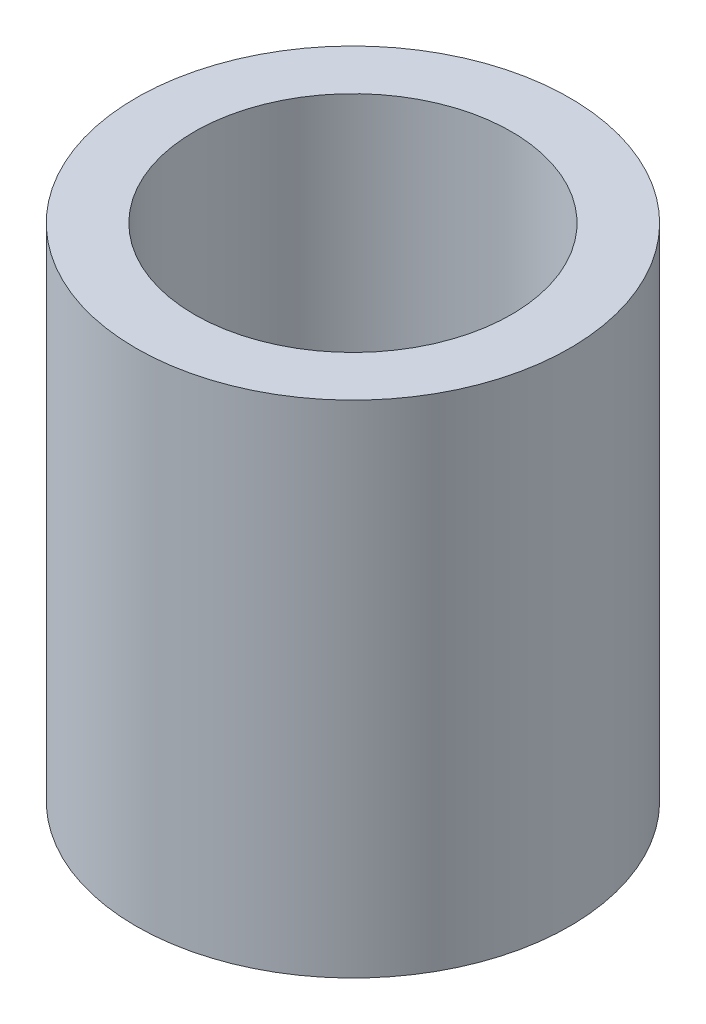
ISO-10303-21;
HEADER;
FILE_DESCRIPTION(('STEP AP214'),'2;1');
FILE_NAME('part.step','',(''),(''),'','','');
FILE_SCHEMA(('AUTOMOTIVE_DESIGN { 1 0 10303 214 1 1 1 1 }'));
ENDSEC;
DATA;
#1=APPLICATION_CONTEXT('core data for automotive mechanical design processes');
#2=APPLICATION_PROTOCOL_DEFINITION('international standard','automotive_design',2000,#1);
#3=PRODUCT_CONTEXT('',#1,'mechanical');
#4=PRODUCT('Part','Part','',(#3));
#5=PRODUCT_RELATED_PRODUCT_CATEGORY('part','',(#4));
#6=PRODUCT_DEFINITION_FORMATION('','',#4);
#7=PRODUCT_DEFINITION_CONTEXT('part definition',#1,'design');
#8=PRODUCT_DEFINITION('design','',#6,#7);
#9=PRODUCT_DEFINITION_SHAPE('','',#8);
#10=(LENGTH_UNIT() NAMED_UNIT(*) SI_UNIT(.MILLI.,.METRE.));
#11=(NAMED_UNIT(*) PLANE_ANGLE_UNIT() SI_UNIT($,.RADIAN.));
#12=(NAMED_UNIT(*) SI_UNIT($,.STERADIAN.) SOLID_ANGLE_UNIT());
#13=UNCERTAINTY_MEASURE_WITH_UNIT(LENGTH_MEASURE(1.E-05),#10,'distance_accuracy_value','');
#14=(GEOMETRIC_REPRESENTATION_CONTEXT(3) GLOBAL_UNCERTAINTY_ASSIGNED_CONTEXT((#13)) GLOBAL_UNIT_ASSIGNED_CONTEXT((#10,
#11,#12)) REPRESENTATION_CONTEXT('',''));
#15=CARTESIAN_POINT('',(0.,0.,0.));
#16=DIRECTION('',(0.,0.,1.));
#17=DIRECTION('',(1.,0.,0.));
#18=AXIS2_PLACEMENT_3D('',#15,#16,#17);
#19=CARTESIAN_POINT('',(0.,30.,0.));
#20=DIRECTION('',(0.,1.,0.));
#21=DIRECTION('',(0.,0.,1.));
#22=AXIS2_PLACEMENT_3D('',#19,#20,#21);
#23=PLANE('',#22);
#24=CARTESIAN_POINT('',(0.,30.,0.));
#25=DIRECTION('',(0.,1.,0.));
#26=DIRECTION('',(0.,0.,1.));
#27=AXIS2_PLACEMENT_3D('',#24,#25,#26);
#28=CIRCLE('',#27,13.);
#29=CARTESIAN_POINT('',(0.,30.,13.));
#30=VERTEX_POINT('',#29);
#31=EDGE_CURVE('E10',#30,#30,#28,.T.);
#32=ORIENTED_EDGE('',*,*,#31,.T.);
#33=EDGE_LOOP('',(#32));
#34=FACE_BOUND('',#33,.T.);
#35=CARTESIAN_POINT('',(0.,30.,0.));
#36=DIRECTION('',(0.,1.,0.));
#37=DIRECTION('',(0.,0.,1.));
#38=AXIS2_PLACEMENT_3D('',#35,#36,#37);
#39=CIRCLE('',#38,9.5);
#40=CARTESIAN_POINT('',(0.,30.,9.5));
#41=VERTEX_POINT('',#40);
#42=EDGE_CURVE('E39',#41,#41,#39,.T.);
#43=ORIENTED_EDGE('',*,*,#42,.F.);
#44=EDGE_LOOP('',(#43));
#45=FACE_BOUND('',#44,.T.);
#46=ADVANCED_FACE('F28',(#34,#45),#23,.T.);
#47=CARTESIAN_POINT('',(0.,0.,0.));
#48=DIRECTION('',(0.,1.,0.));
#49=DIRECTION('',(0.,0.,1.));
#50=AXIS2_PLACEMENT_3D('',#47,#48,#49);
#51=PLANE('',#50);
#52=CARTESIAN_POINT('',(0.,0.,0.));
#53=DIRECTION('',(0.,1.,0.));
#54=DIRECTION('',(0.,0.,1.));
#55=AXIS2_PLACEMENT_3D('',#52,#53,#54);
#56=CIRCLE('',#55,13.);
#57=CARTESIAN_POINT('',(0.,0.,13.));
#58=VERTEX_POINT('',#57);
#59=EDGE_CURVE('E35',#58,#58,#56,.T.);
#60=ORIENTED_EDGE('',*,*,#59,.F.);
#61=EDGE_LOOP('',(#60));
#62=FACE_BOUND('',#61,.T.);
#63=CARTESIAN_POINT('',(0.,0.,0.));
#64=DIRECTION('',(0.,1.,0.));
#65=DIRECTION('',(0.,0.,1.));
#66=AXIS2_PLACEMENT_3D('',#63,#64,#65);
#67=CIRCLE('',#66,9.5);
#68=CARTESIAN_POINT('',(0.,0.,9.5));
#69=VERTEX_POINT('',#68);
#70=EDGE_CURVE('E43',#69,#69,#67,.T.);
#71=ORIENTED_EDGE('',*,*,#70,.T.);
#72=EDGE_LOOP('',(#71));
#73=FACE_BOUND('',#72,.T.);
#74=ADVANCED_FACE('F49',(#62,#73),#51,.F.);
#75=CARTESIAN_POINT('',(0.,30.,0.));
#76=DIRECTION('',(0.,-1.,0.));
#77=DIRECTION('',(0.,0.,-1.));
#78=AXIS2_PLACEMENT_3D('',#75,#76,#77);
#79=CYLINDRICAL_SURFACE('',#78,13.);
#80=ORIENTED_EDGE('',*,*,#31,.F.);
#81=EDGE_LOOP('',(#80));
#82=FACE_BOUND('',#81,.T.);
#83=ORIENTED_EDGE('',*,*,#59,.T.);
#84=EDGE_LOOP('',(#83));
#85=FACE_BOUND('',#84,.T.);
#86=ADVANCED_FACE('F30',(#82,#85),#79,.T.);
#87=CARTESIAN_POINT('',(0.,30.,0.));
#88=DIRECTION('',(0.,-1.,0.));
#89=DIRECTION('',(0.,0.,-1.));
#90=AXIS2_PLACEMENT_3D('',#87,#88,#89);
#91=CYLINDRICAL_SURFACE('',#90,9.5);
#92=ORIENTED_EDGE('',*,*,#42,.T.);
#93=EDGE_LOOP('',(#92));
#94=FACE_BOUND('',#93,.T.);
#95=ORIENTED_EDGE('',*,*,#70,.F.);
#96=EDGE_LOOP('',(#95));
#97=FACE_BOUND('',#96,.T.);
#98=ADVANCED_FACE('F51',(#94,#97),#91,.F.);
#99=CLOSED_SHELL('',(#46,#74,#86,#98));
#100=MANIFOLD_SOLID_BREP('B2',#99);
#101=ADVANCED_BREP_SHAPE_REPRESENTATION('',(#18,#100),#14);
#102=SHAPE_DEFINITION_REPRESENTATION(#9,#101);
ENDSEC;
END-ISO-10303-21;
